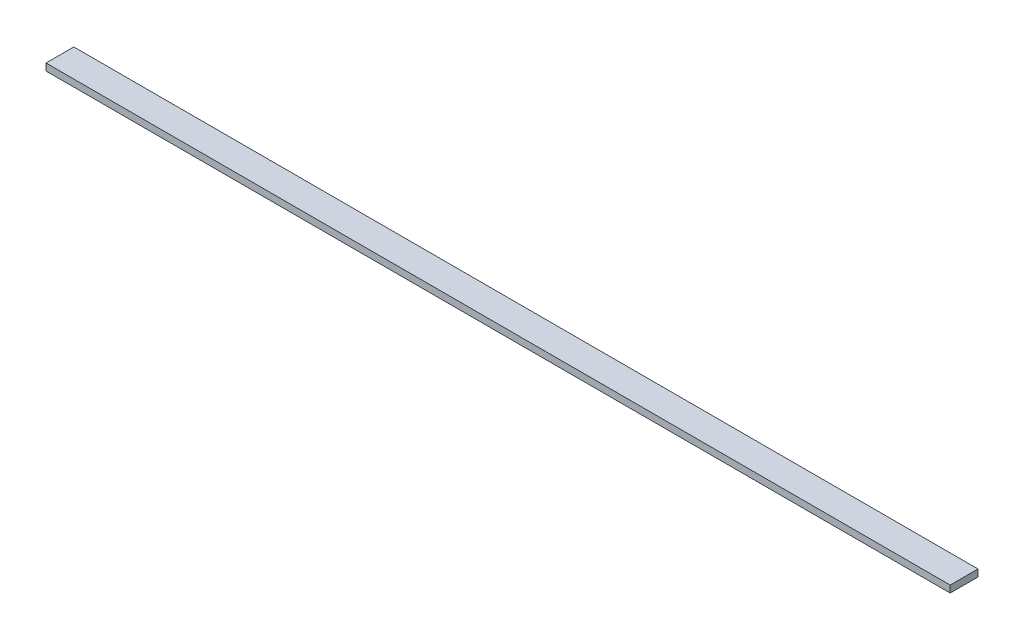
ISO-10303-21;
HEADER;
FILE_DESCRIPTION(('STEP AP214'),'2;1');
FILE_NAME('part.step','',(''),(''),'','','');
FILE_SCHEMA(('AUTOMOTIVE_DESIGN { 1 0 10303 214 1 1 1 1 }'));
ENDSEC;
DATA;
#1=APPLICATION_CONTEXT('core data for automotive mechanical design processes');
#2=APPLICATION_PROTOCOL_DEFINITION('international standard','automotive_design',2000,#1);
#3=PRODUCT_CONTEXT('',#1,'mechanical');
#4=PRODUCT('Part','Part','',(#3));
#5=PRODUCT_RELATED_PRODUCT_CATEGORY('part','',(#4));
#6=PRODUCT_DEFINITION_FORMATION('','',#4);
#7=PRODUCT_DEFINITION_CONTEXT('part definition',#1,'design');
#8=PRODUCT_DEFINITION('design','',#6,#7);
#9=PRODUCT_DEFINITION_SHAPE('','',#8);
#10=(LENGTH_UNIT() NAMED_UNIT(*) SI_UNIT(.MILLI.,.METRE.));
#11=(NAMED_UNIT(*) PLANE_ANGLE_UNIT() SI_UNIT($,.RADIAN.));
#12=(NAMED_UNIT(*) SI_UNIT($,.STERADIAN.) SOLID_ANGLE_UNIT());
#13=UNCERTAINTY_MEASURE_WITH_UNIT(LENGTH_MEASURE(1.E-05),#10,'distance_accuracy_value','');
#14=(GEOMETRIC_REPRESENTATION_CONTEXT(3) GLOBAL_UNCERTAINTY_ASSIGNED_CONTEXT((#13)) GLOBAL_UNIT_ASSIGNED_CONTEXT((#10,
#11,#12)) REPRESENTATION_CONTEXT('',''));
#15=CARTESIAN_POINT('',(0.,0.,0.));
#16=DIRECTION('',(0.,0.,1.));
#17=DIRECTION('',(1.,0.,0.));
#18=AXIS2_PLACEMENT_3D('',#15,#16,#17);
#19=CARTESIAN_POINT('',(412.75,6.35,12.7));
#20=DIRECTION('',(-1.,0.,0.));
#21=DIRECTION('',(0.,0.,1.));
#22=AXIS2_PLACEMENT_3D('',#19,#20,#21);
#23=PLANE('',#22);
#24=DIRECTION('',(0.,0.,-1.));
#25=VECTOR('',#24,1.);
#26=CARTESIAN_POINT('',(412.75,0.,12.7));
#27=LINE('',#26,#25);
#28=CARTESIAN_POINT('',(412.75,0.,12.7));
#29=VERTEX_POINT('',#28);
#30=CARTESIAN_POINT('',(412.75,0.,-12.7));
#31=VERTEX_POINT('',#30);
#32=EDGE_CURVE('E98',#29,#31,#27,.T.);
#33=ORIENTED_EDGE('',*,*,#32,.T.);
#34=DIRECTION('',(0.,-1.,0.));
#35=VECTOR('',#34,1.);
#36=CARTESIAN_POINT('',(412.75,6.35,-12.7));
#37=LINE('',#36,#35);
#38=CARTESIAN_POINT('',(412.75,6.35,-12.7));
#39=VERTEX_POINT('',#38);
#40=EDGE_CURVE('E11',#39,#31,#37,.T.);
#41=ORIENTED_EDGE('',*,*,#40,.F.);
#42=DIRECTION('',(0.,0.,-1.));
#43=VECTOR('',#42,1.);
#44=CARTESIAN_POINT('',(412.75,6.35,12.7));
#45=LINE('',#44,#43);
#46=CARTESIAN_POINT('',(412.75,6.35,12.7));
#47=VERTEX_POINT('',#46);
#48=EDGE_CURVE('E86',#47,#39,#45,.T.);
#49=ORIENTED_EDGE('',*,*,#48,.F.);
#50=DIRECTION('',(0.,-1.,0.));
#51=VECTOR('',#50,1.);
#52=CARTESIAN_POINT('',(412.75,6.35,12.7));
#53=LINE('',#52,#51);
#54=EDGE_CURVE('E94',#47,#29,#53,.T.);
#55=ORIENTED_EDGE('',*,*,#54,.T.);
#56=EDGE_LOOP('',(#33,#41,#49,#55));
#57=FACE_BOUND('',#56,.T.);
#58=ADVANCED_FACE('F35',(#57),#23,.F.);
#59=CARTESIAN_POINT('',(-412.75,6.35,-12.7));
#60=DIRECTION('',(0.,0.,1.));
#61=DIRECTION('',(1.,0.,0.));
#62=AXIS2_PLACEMENT_3D('',#59,#60,#61);
#63=PLANE('',#62);
#64=DIRECTION('',(-1.,0.,0.));
#65=VECTOR('',#64,1.);
#66=CARTESIAN_POINT('',(-412.75,0.,-12.7));
#67=LINE('',#66,#65);
#68=CARTESIAN_POINT('',(-412.75,0.,-12.7));
#69=VERTEX_POINT('',#68);
#70=EDGE_CURVE('E90',#31,#69,#67,.T.);
#71=ORIENTED_EDGE('',*,*,#70,.T.);
#72=DIRECTION('',(0.,-1.,0.));
#73=VECTOR('',#72,1.);
#74=CARTESIAN_POINT('',(-412.75,6.35,-12.7));
#75=LINE('',#74,#73);
#76=CARTESIAN_POINT('',(-412.75,6.35,-12.7));
#77=VERTEX_POINT('',#76);
#78=EDGE_CURVE('E43',#77,#69,#75,.T.);
#79=ORIENTED_EDGE('',*,*,#78,.F.);
#80=DIRECTION('',(-1.,0.,0.));
#81=VECTOR('',#80,1.);
#82=CARTESIAN_POINT('',(-412.75,6.35,-12.7));
#83=LINE('',#82,#81);
#84=EDGE_CURVE('E81',#39,#77,#83,.T.);
#85=ORIENTED_EDGE('',*,*,#84,.F.);
#86=ORIENTED_EDGE('',*,*,#40,.T.);
#87=EDGE_LOOP('',(#71,#79,#85,#86));
#88=FACE_BOUND('',#87,.T.);
#89=ADVANCED_FACE('F89',(#88),#63,.F.);
#90=CARTESIAN_POINT('',(-412.75,6.35,12.7));
#91=DIRECTION('',(1.,0.,0.));
#92=DIRECTION('',(0.,0.,-1.));
#93=AXIS2_PLACEMENT_3D('',#90,#91,#92);
#94=PLANE('',#93);
#95=DIRECTION('',(0.,0.,1.));
#96=VECTOR('',#95,1.);
#97=CARTESIAN_POINT('',(-412.75,0.,12.7));
#98=LINE('',#97,#96);
#99=CARTESIAN_POINT('',(-412.75,0.,12.7));
#100=VERTEX_POINT('',#99);
#101=EDGE_CURVE('E68',#69,#100,#98,.T.);
#102=ORIENTED_EDGE('',*,*,#101,.T.);
#103=DIRECTION('',(0.,-1.,0.));
#104=VECTOR('',#103,1.);
#105=CARTESIAN_POINT('',(-412.75,6.35,12.7));
#106=LINE('',#105,#104);
#107=CARTESIAN_POINT('',(-412.75,6.35,12.7));
#108=VERTEX_POINT('',#107);
#109=EDGE_CURVE('E91',#108,#100,#106,.T.);
#110=ORIENTED_EDGE('',*,*,#109,.F.);
#111=DIRECTION('',(0.,0.,1.));
#112=VECTOR('',#111,1.);
#113=CARTESIAN_POINT('',(-412.75,6.35,12.7));
#114=LINE('',#113,#112);
#115=EDGE_CURVE('E84',#77,#108,#114,.T.);
#116=ORIENTED_EDGE('',*,*,#115,.F.);
#117=ORIENTED_EDGE('',*,*,#78,.T.);
#118=EDGE_LOOP('',(#102,#110,#116,#117));
#119=FACE_BOUND('',#118,.T.);
#120=ADVANCED_FACE('F92',(#119),#94,.F.);
#121=CARTESIAN_POINT('',(-412.75,6.35,12.7));
#122=DIRECTION('',(0.,0.,-1.));
#123=DIRECTION('',(-1.,0.,0.));
#124=AXIS2_PLACEMENT_3D('',#121,#122,#123);
#125=PLANE('',#124);
#126=DIRECTION('',(1.,0.,0.));
#127=VECTOR('',#126,1.);
#128=CARTESIAN_POINT('',(-412.75,0.,12.7));
#129=LINE('',#128,#127);
#130=EDGE_CURVE('E74',#100,#29,#129,.T.);
#131=ORIENTED_EDGE('',*,*,#130,.T.);
#132=ORIENTED_EDGE('',*,*,#54,.F.);
#133=DIRECTION('',(1.,0.,0.));
#134=VECTOR('',#133,1.);
#135=CARTESIAN_POINT('',(-412.75,6.35,12.7));
#136=LINE('',#135,#134);
#137=EDGE_CURVE('E51',#108,#47,#136,.T.);
#138=ORIENTED_EDGE('',*,*,#137,.F.);
#139=ORIENTED_EDGE('',*,*,#109,.T.);
#140=EDGE_LOOP('',(#131,#132,#138,#139));
#141=FACE_BOUND('',#140,.T.);
#142=ADVANCED_FACE('F105',(#141),#125,.F.);
#143=CARTESIAN_POINT('',(0.,6.35,0.));
#144=DIRECTION('',(0.,-1.,0.));
#145=DIRECTION('',(0.,0.,-1.));
#146=AXIS2_PLACEMENT_3D('',#143,#144,#145);
#147=PLANE('',#146);
#148=ORIENTED_EDGE('',*,*,#48,.T.);
#149=ORIENTED_EDGE('',*,*,#84,.T.);
#150=ORIENTED_EDGE('',*,*,#115,.T.);
#151=ORIENTED_EDGE('',*,*,#137,.T.);
#152=EDGE_LOOP('',(#148,#149,#150,#151));
#153=FACE_BOUND('',#152,.T.);
#154=ADVANCED_FACE('F82',(#153),#147,.F.);
#155=CARTESIAN_POINT('',(0.,0.,0.));
#156=DIRECTION('',(0.,-1.,0.));
#157=DIRECTION('',(0.,0.,-1.));
#158=AXIS2_PLACEMENT_3D('',#155,#156,#157);
#159=PLANE('',#158);
#160=ORIENTED_EDGE('',*,*,#32,.F.);
#161=ORIENTED_EDGE('',*,*,#130,.F.);
#162=ORIENTED_EDGE('',*,*,#101,.F.);
#163=ORIENTED_EDGE('',*,*,#70,.F.);
#164=EDGE_LOOP('',(#160,#161,#162,#163));
#165=FACE_BOUND('',#164,.T.);
#166=ADVANCED_FACE('F108',(#165),#159,.T.);
#167=CLOSED_SHELL('',(#58,#89,#120,#142,#154,#166));
#168=MANIFOLD_SOLID_BREP('B2',#167);
#169=ADVANCED_BREP_SHAPE_REPRESENTATION('',(#18,#168),#14);
#170=SHAPE_DEFINITION_REPRESENTATION(#9,#169);
ENDSEC;
END-ISO-10303-21;
